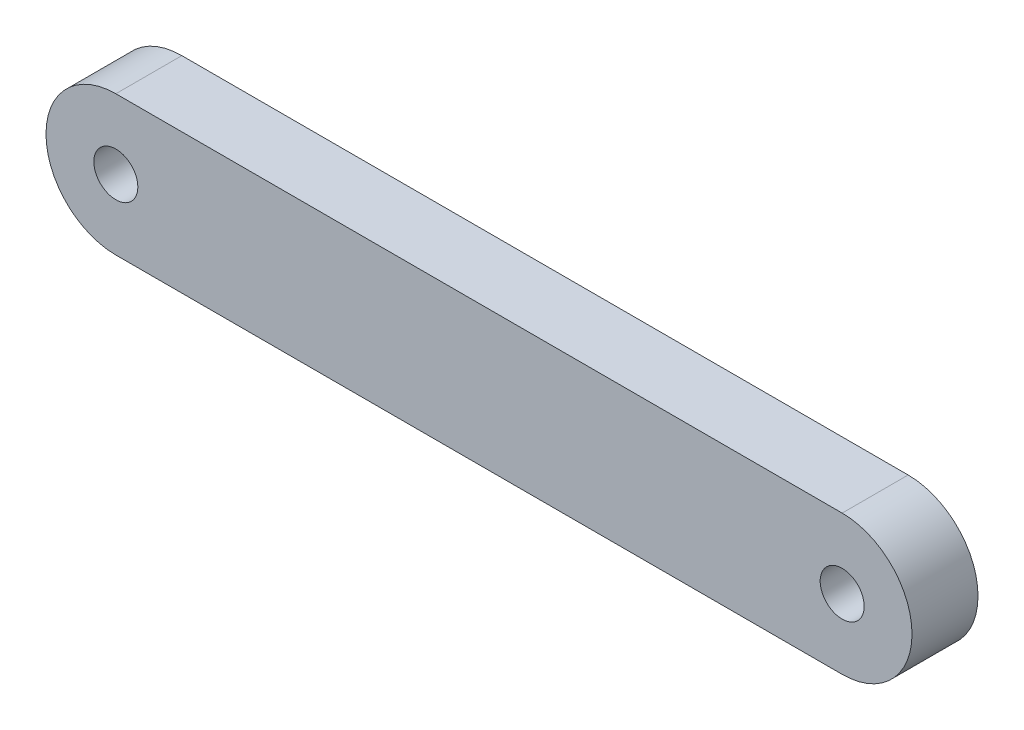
ISO-10303-21;
HEADER;
FILE_DESCRIPTION(('STEP AP214'),'2;1');
FILE_NAME('part.step','',(''),(''),'','','');
FILE_SCHEMA(('AUTOMOTIVE_DESIGN { 1 0 10303 214 1 1 1 1 }'));
ENDSEC;
DATA;
#1=APPLICATION_CONTEXT('core data for automotive mechanical design processes');
#2=APPLICATION_PROTOCOL_DEFINITION('international standard','automotive_design',2000,#1);
#3=PRODUCT_CONTEXT('',#1,'mechanical');
#4=PRODUCT('Part','Part','',(#3));
#5=PRODUCT_RELATED_PRODUCT_CATEGORY('part','',(#4));
#6=PRODUCT_DEFINITION_FORMATION('','',#4);
#7=PRODUCT_DEFINITION_CONTEXT('part definition',#1,'design');
#8=PRODUCT_DEFINITION('design','',#6,#7);
#9=PRODUCT_DEFINITION_SHAPE('','',#8);
#10=(LENGTH_UNIT() NAMED_UNIT(*) SI_UNIT(.MILLI.,.METRE.));
#11=(NAMED_UNIT(*) PLANE_ANGLE_UNIT() SI_UNIT($,.RADIAN.));
#12=(NAMED_UNIT(*) SI_UNIT($,.STERADIAN.) SOLID_ANGLE_UNIT());
#13=UNCERTAINTY_MEASURE_WITH_UNIT(LENGTH_MEASURE(1.E-05),#10,'distance_accuracy_value','');
#14=(GEOMETRIC_REPRESENTATION_CONTEXT(3) GLOBAL_UNCERTAINTY_ASSIGNED_CONTEXT((#13)) GLOBAL_UNIT_ASSIGNED_CONTEXT((#10,
#11,#12)) REPRESENTATION_CONTEXT('',''));
#15=CARTESIAN_POINT('',(0.,0.,0.));
#16=DIRECTION('',(0.,0.,1.));
#17=DIRECTION('',(1.,0.,0.));
#18=AXIS2_PLACEMENT_3D('',#15,#16,#17);
#19=CARTESIAN_POINT('',(0.,-3.175,3.000000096));
#20=DIRECTION('',(0.,1.,0.));
#21=DIRECTION('',(0.,0.,1.));
#22=AXIS2_PLACEMENT_3D('',#19,#20,#21);
#23=PLANE('',#22);
#24=DIRECTION('',(1.,0.,0.));
#25=VECTOR('',#24,1.);
#26=CARTESIAN_POINT('',(0.,-3.175,0.));
#27=LINE('',#26,#25);
#28=CARTESIAN_POINT('',(0.,-3.175,0.));
#29=VERTEX_POINT('',#28);
#30=CARTESIAN_POINT('',(33.02,-3.175,0.));
#31=VERTEX_POINT('',#30);
#32=EDGE_CURVE('E90',#29,#31,#27,.T.);
#33=ORIENTED_EDGE('',*,*,#32,.T.);
#34=DIRECTION('',(0.,0.,-1.));
#35=VECTOR('',#34,1.);
#36=CARTESIAN_POINT('',(33.02,-3.175,3.000000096));
#37=LINE('',#36,#35);
#38=CARTESIAN_POINT('',(33.02,-3.175,3.000000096));
#39=VERTEX_POINT('',#38);
#40=EDGE_CURVE('E11',#39,#31,#37,.T.);
#41=ORIENTED_EDGE('',*,*,#40,.F.);
#42=DIRECTION('',(1.,0.,0.));
#43=VECTOR('',#42,1.);
#44=CARTESIAN_POINT('',(0.,-3.175,3.000000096));
#45=LINE('',#44,#43);
#46=CARTESIAN_POINT('',(0.,-3.175,3.000000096));
#47=VERTEX_POINT('',#46);
#48=EDGE_CURVE('E96',#47,#39,#45,.T.);
#49=ORIENTED_EDGE('',*,*,#48,.F.);
#50=DIRECTION('',(0.,0.,-1.));
#51=VECTOR('',#50,1.);
#52=CARTESIAN_POINT('',(0.,-3.175,3.000000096));
#53=LINE('',#52,#51);
#54=EDGE_CURVE('E62',#47,#29,#53,.T.);
#55=ORIENTED_EDGE('',*,*,#54,.T.);
#56=EDGE_LOOP('',(#33,#41,#49,#55));
#57=FACE_BOUND('',#56,.T.);
#58=ADVANCED_FACE('F41',(#57),#23,.F.);
#59=CARTESIAN_POINT('',(0.,3.175,3.000000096));
#60=DIRECTION('',(0.,1.,0.));
#61=DIRECTION('',(0.,0.,1.));
#62=AXIS2_PLACEMENT_3D('',#59,#60,#61);
#63=PLANE('',#62);
#64=DIRECTION('',(1.,0.,0.));
#65=VECTOR('',#64,1.);
#66=CARTESIAN_POINT('',(0.,3.175,0.));
#67=LINE('',#66,#65);
#68=CARTESIAN_POINT('',(0.,3.175,0.));
#69=VERTEX_POINT('',#68);
#70=CARTESIAN_POINT('',(33.02,3.175,0.));
#71=VERTEX_POINT('',#70);
#72=EDGE_CURVE('E92',#69,#71,#67,.T.);
#73=ORIENTED_EDGE('',*,*,#72,.F.);
#74=DIRECTION('',(0.,0.,-1.));
#75=VECTOR('',#74,1.);
#76=CARTESIAN_POINT('',(0.,3.175,3.000000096));
#77=LINE('',#76,#75);
#78=CARTESIAN_POINT('',(0.,3.175,3.000000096));
#79=VERTEX_POINT('',#78);
#80=EDGE_CURVE('E105',#79,#69,#77,.T.);
#81=ORIENTED_EDGE('',*,*,#80,.F.);
#82=DIRECTION('',(1.,0.,0.));
#83=VECTOR('',#82,1.);
#84=CARTESIAN_POINT('',(0.,3.175,3.000000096));
#85=LINE('',#84,#83);
#86=CARTESIAN_POINT('',(33.02,3.175,3.000000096));
#87=VERTEX_POINT('',#86);
#88=EDGE_CURVE('E101',#79,#87,#85,.T.);
#89=ORIENTED_EDGE('',*,*,#88,.T.);
#90=DIRECTION('',(0.,0.,-1.));
#91=VECTOR('',#90,1.);
#92=CARTESIAN_POINT('',(33.02,3.175,3.000000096));
#93=LINE('',#92,#91);
#94=EDGE_CURVE('E48',#87,#71,#93,.T.);
#95=ORIENTED_EDGE('',*,*,#94,.T.);
#96=EDGE_LOOP('',(#73,#81,#89,#95));
#97=FACE_BOUND('',#96,.T.);
#98=ADVANCED_FACE('F108',(#97),#63,.T.);
#99=CARTESIAN_POINT('',(0.,0.,3.000000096));
#100=DIRECTION('',(0.,0.,-1.));
#101=DIRECTION('',(-1.,0.,0.));
#102=AXIS2_PLACEMENT_3D('',#99,#100,#101);
#103=PLANE('',#102);
#104=CARTESIAN_POINT('',(33.02,0.,3.000000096));
#105=DIRECTION('',(0.,0.,1.));
#106=DIRECTION('',(1.,0.,0.));
#107=AXIS2_PLACEMENT_3D('',#104,#105,#106);
#108=CIRCLE('',#107,1.000000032);
#109=CARTESIAN_POINT('',(34.020000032,0.,3.000000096));
#110=VERTEX_POINT('',#109);
#111=EDGE_CURVE('E116',#110,#110,#108,.T.);
#112=ORIENTED_EDGE('',*,*,#111,.F.);
#113=EDGE_LOOP('',(#112));
#114=FACE_BOUND('',#113,.T.);
#115=CARTESIAN_POINT('',(0.,0.,3.000000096));
#116=DIRECTION('',(0.,0.,1.));
#117=DIRECTION('',(1.,0.,0.));
#118=AXIS2_PLACEMENT_3D('',#115,#116,#117);
#119=CIRCLE('',#118,1.000000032);
#120=CARTESIAN_POINT('',(1.000000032,0.,3.000000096));
#121=VERTEX_POINT('',#120);
#122=EDGE_CURVE('E121',#121,#121,#119,.T.);
#123=ORIENTED_EDGE('',*,*,#122,.F.);
#124=EDGE_LOOP('',(#123));
#125=FACE_BOUND('',#124,.T.);
#126=ORIENTED_EDGE('',*,*,#88,.F.);
#127=CARTESIAN_POINT('',(0.,0.,3.000000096));
#128=DIRECTION('',(0.,0.,1.));
#129=DIRECTION('',(1.,0.,0.));
#130=AXIS2_PLACEMENT_3D('',#127,#128,#129);
#131=CIRCLE('',#130,3.175);
#132=EDGE_CURVE('E98',#79,#47,#131,.T.);
#133=ORIENTED_EDGE('',*,*,#132,.T.);
#134=ORIENTED_EDGE('',*,*,#48,.T.);
#135=CARTESIAN_POINT('',(33.02,0.,3.000000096));
#136=DIRECTION('',(0.,0.,1.));
#137=DIRECTION('',(1.,0.,0.));
#138=AXIS2_PLACEMENT_3D('',#135,#136,#137);
#139=CIRCLE('',#138,3.175);
#140=EDGE_CURVE('E80',#39,#87,#139,.T.);
#141=ORIENTED_EDGE('',*,*,#140,.T.);
#142=EDGE_LOOP('',(#126,#133,#134,#141));
#143=FACE_BOUND('',#142,.T.);
#144=ADVANCED_FACE('F112',(#114,#125,#143),#103,.F.);
#145=CARTESIAN_POINT('',(0.,0.,0.));
#146=DIRECTION('',(0.,0.,-1.));
#147=DIRECTION('',(-1.,0.,0.));
#148=AXIS2_PLACEMENT_3D('',#145,#146,#147);
#149=PLANE('',#148);
#150=CARTESIAN_POINT('',(0.,0.,0.));
#151=DIRECTION('',(0.,0.,1.));
#152=DIRECTION('',(1.,0.,0.));
#153=AXIS2_PLACEMENT_3D('',#150,#151,#152);
#154=CIRCLE('',#153,1.000000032);
#155=CARTESIAN_POINT('',(1.000000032,0.,0.));
#156=VERTEX_POINT('',#155);
#157=EDGE_CURVE('E125',#156,#156,#154,.T.);
#158=ORIENTED_EDGE('',*,*,#157,.T.);
#159=EDGE_LOOP('',(#158));
#160=FACE_BOUND('',#159,.T.);
#161=CARTESIAN_POINT('',(33.02,0.,0.));
#162=DIRECTION('',(0.,0.,1.));
#163=DIRECTION('',(1.,0.,0.));
#164=AXIS2_PLACEMENT_3D('',#161,#162,#163);
#165=CIRCLE('',#164,1.000000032);
#166=CARTESIAN_POINT('',(34.020000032,0.,0.));
#167=VERTEX_POINT('',#166);
#168=EDGE_CURVE('E113',#167,#167,#165,.T.);
#169=ORIENTED_EDGE('',*,*,#168,.T.);
#170=EDGE_LOOP('',(#169));
#171=FACE_BOUND('',#170,.T.);
#172=ORIENTED_EDGE('',*,*,#32,.F.);
#173=CARTESIAN_POINT('',(0.,0.,0.));
#174=DIRECTION('',(0.,0.,1.));
#175=DIRECTION('',(1.,0.,0.));
#176=AXIS2_PLACEMENT_3D('',#173,#174,#175);
#177=CIRCLE('',#176,3.175);
#178=EDGE_CURVE('E94',#69,#29,#177,.T.);
#179=ORIENTED_EDGE('',*,*,#178,.F.);
#180=ORIENTED_EDGE('',*,*,#72,.T.);
#181=CARTESIAN_POINT('',(33.02,0.,0.));
#182=DIRECTION('',(0.,0.,1.));
#183=DIRECTION('',(1.,0.,0.));
#184=AXIS2_PLACEMENT_3D('',#181,#182,#183);
#185=CIRCLE('',#184,3.175);
#186=EDGE_CURVE('E54',#31,#71,#185,.T.);
#187=ORIENTED_EDGE('',*,*,#186,.F.);
#188=EDGE_LOOP('',(#172,#179,#180,#187));
#189=FACE_BOUND('',#188,.T.);
#190=ADVANCED_FACE('F88',(#160,#171,#189),#149,.T.);
#191=CARTESIAN_POINT('',(0.,0.,0.));
#192=DIRECTION('',(0.,0.,1.));
#193=DIRECTION('',(1.,0.,0.));
#194=AXIS2_PLACEMENT_3D('',#191,#192,#193);
#195=CYLINDRICAL_SURFACE('',#194,3.175);
#196=ORIENTED_EDGE('',*,*,#178,.T.);
#197=ORIENTED_EDGE('',*,*,#54,.F.);
#198=ORIENTED_EDGE('',*,*,#132,.F.);
#199=ORIENTED_EDGE('',*,*,#80,.T.);
#200=EDGE_LOOP('',(#196,#197,#198,#199));
#201=FACE_BOUND('',#200,.T.);
#202=ADVANCED_FACE('F133',(#201),#195,.T.);
#203=CARTESIAN_POINT('',(0.,0.,0.));
#204=DIRECTION('',(0.,0.,1.));
#205=DIRECTION('',(1.,0.,0.));
#206=AXIS2_PLACEMENT_3D('',#203,#204,#205);
#207=CYLINDRICAL_SURFACE('',#206,1.000000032);
#208=ORIENTED_EDGE('',*,*,#122,.T.);
#209=EDGE_LOOP('',(#208));
#210=FACE_BOUND('',#209,.T.);
#211=ORIENTED_EDGE('',*,*,#157,.F.);
#212=EDGE_LOOP('',(#211));
#213=FACE_BOUND('',#212,.T.);
#214=ADVANCED_FACE('F135',(#210,#213),#207,.F.);
#215=CARTESIAN_POINT('',(33.02,0.,0.));
#216=DIRECTION('',(0.,0.,1.));
#217=DIRECTION('',(1.,0.,0.));
#218=AXIS2_PLACEMENT_3D('',#215,#216,#217);
#219=CYLINDRICAL_SURFACE('',#218,3.175);
#220=ORIENTED_EDGE('',*,*,#140,.F.);
#221=ORIENTED_EDGE('',*,*,#40,.T.);
#222=ORIENTED_EDGE('',*,*,#186,.T.);
#223=ORIENTED_EDGE('',*,*,#94,.F.);
#224=EDGE_LOOP('',(#220,#221,#222,#223));
#225=FACE_BOUND('',#224,.T.);
#226=ADVANCED_FACE('F78',(#225),#219,.T.);
#227=CARTESIAN_POINT('',(33.02,0.,0.));
#228=DIRECTION('',(0.,0.,1.));
#229=DIRECTION('',(1.,0.,0.));
#230=AXIS2_PLACEMENT_3D('',#227,#228,#229);
#231=CYLINDRICAL_SURFACE('',#230,1.000000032);
#232=ORIENTED_EDGE('',*,*,#111,.T.);
#233=EDGE_LOOP('',(#232));
#234=FACE_BOUND('',#233,.T.);
#235=ORIENTED_EDGE('',*,*,#168,.F.);
#236=EDGE_LOOP('',(#235));
#237=FACE_BOUND('',#236,.T.);
#238=ADVANCED_FACE('F155',(#234,#237),#231,.F.);
#239=CLOSED_SHELL('',(#58,#98,#144,#190,#202,#214,#226,#238));
#240=MANIFOLD_SOLID_BREP('B2',#239);
#241=ADVANCED_BREP_SHAPE_REPRESENTATION('',(#18,#240),#14);
#242=SHAPE_DEFINITION_REPRESENTATION(#9,#241);
ENDSEC;
END-ISO-10303-21;
